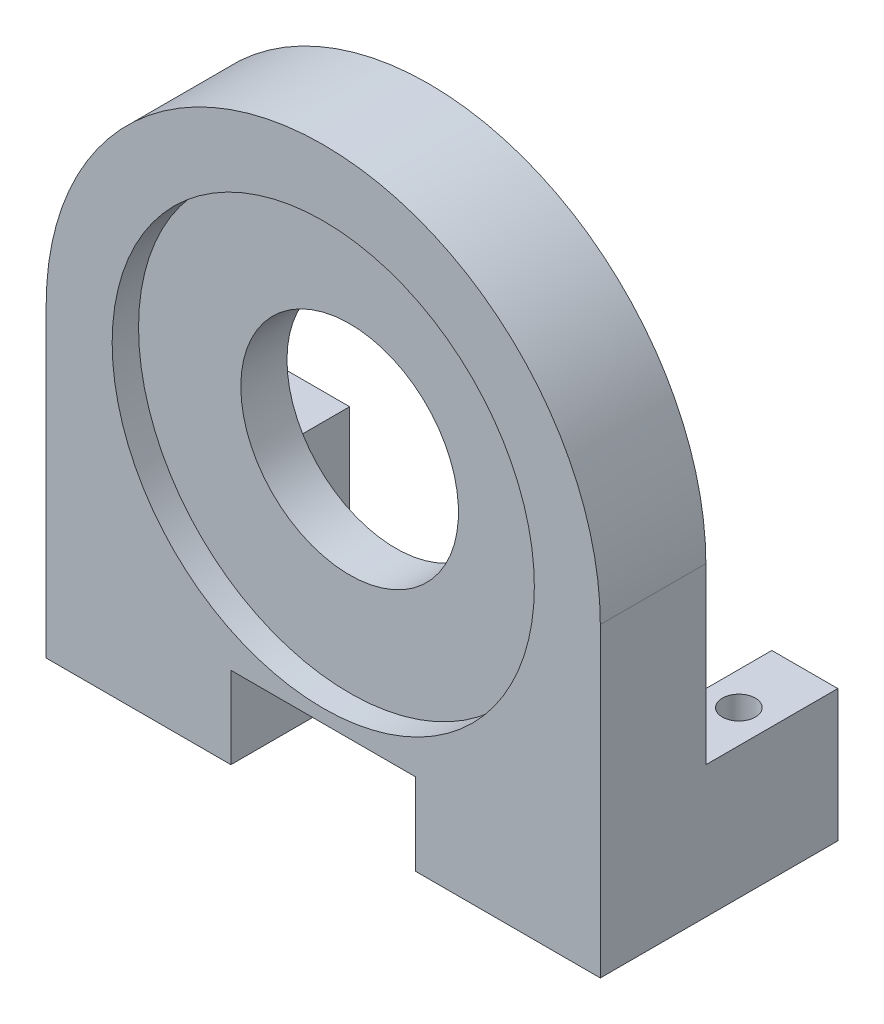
from build123d import *

# Parameters (mm, degrees)
SKETCH2_R                = 16
BOSS_EXTRUDE1_DEPTH      = 4
BOSS_EXTRUDE2_DEPTH      = 2
BOSS_EXTRUDE2_DEPTH_BACK = 1.5
SKETCH3_R                = 16
SKETCH3_R_2              = 8.25
SKETCH6_W                = 5
SKETCH6_H                = 10
BOSS_EXTRUDE4_DEPTH      = 10
SKETCH7_R                = 1.25
CUT_EXTRUDE2_DEPTH       = 10
SKETCH8_W                = 14
SKETCH8_H                = 12.4
CUT_EXTRUDE3_DEPTH       = 50.94637124


with BuildPart() as part:
    # Sketch2 → Boss-Extrude1 (new, symmetric)
    with BuildSketch(Plane.XY):
        with BuildLine():
            Line((-21, 0), (21, 0))
            Line((21, 0), (21, 23.2))
            ThreePointArc((21, 23.2), (0, 44.2), (-21, 23.2))
            Line((-21, 23.2), (-21, 0))
        make_face()
        with Locations((0, 23.2)):
            Circle(SKETCH2_R, mode=Mode.SUBTRACT)
    extrude(amount=BOSS_EXTRUDE1_DEPTH, both=True)

    # Sketch3 → Boss-Extrude2 (add, two sides: drawn at the far end of the back side and taken through both)
    with BuildSketch(Plane.XY.offset(-BOSS_EXTRUDE2_DEPTH_BACK)):
        with Locations(Location((0, 23.2, 0), (0, 0, 180))):
            Circle(SKETCH3_R)
        with Locations(Location((0, 23.2, 0), (0, 0, 180))):
            Circle(SKETCH3_R_2, mode=Mode.SUBTRACT)
    extrude(amount=BOSS_EXTRUDE2_DEPTH + BOSS_EXTRUDE2_DEPTH_BACK)

    # Sketch6 → Boss-Extrude4 (add)
    with BuildSketch(Plane(origin=(0, 0, -4), x_dir=(-1, 0, 0), z_dir=(0, 0, -1))):
        with Locations((-18.5, 5)):
            Rectangle(SKETCH6_W, SKETCH6_H)
        with Locations((18.5, 5)):
            Rectangle(SKETCH6_W, SKETCH6_H)
    extrude(amount=BOSS_EXTRUDE4_DEPTH)

    # Sketch7 → Cut-Extrude2 (cut)
    with BuildSketch(Plane.XZ):
        with Locations(Location((-18.5, -9, 0), (0, 0, 270))):
            Circle(SKETCH7_R)
        with Locations((18.5, -9)):
            Circle(SKETCH7_R)
        with Locations(Location((-18.5, -1, 0), (0, 0, 270))):
            Circle(SKETCH7_R)
        with Locations((18.5, -1)):
            Circle(SKETCH7_R)
    extrude(amount=-CUT_EXTRUDE2_DEPTH, mode=Mode.SUBTRACT)

    # Sketch8 → Cut-Extrude3 (cut, through all)
    with BuildSketch(Plane(origin=(0, 0, -4), x_dir=(-1, 0, 0), z_dir=(0, 0, -1))):
        Rectangle(SKETCH8_W, SKETCH8_H)
    extrude(amount=-CUT_EXTRUDE3_DEPTH, mode=Mode.SUBTRACT)


solid = part.part
